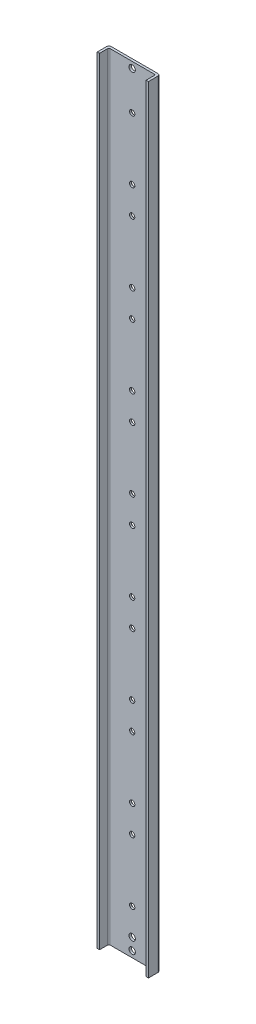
from build123d import *

# Parameters (mm, degrees)
SKETCH1_W                   = 66
SKETCH1_H                   = 15
BOSS_EXTRUDE1_DEPTH         = 500
SKETCH2_W                   = 60
SKETCH2_H                   = 12
CUT_EXTRUDE1_DEPTH          = 1001.572461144
FILLET1_R                   = 3
FILLET2_R                   = 1.5
M8_TAPPED_HOLE1_AT_2_COUNT  = 2
M8_TAPPED_HOLE1_AT_2_PITCH  = 80
M8_TAPPED_HOLE1_AT_3_COUNT  = 2
M8_TAPPED_HOLE1_AT_3_PITCH  = 115
M8_TAPPED_HOLE1_AT_4_COUNT  = 2
M8_TAPPED_HOLE1_AT_4_PITCH  = 195
M8_TAPPED_HOLE1_AT_5_COUNT  = 2
M8_TAPPED_HOLE1_AT_5_PITCH  = 230
M8_TAPPED_HOLE1_AT_6_COUNT  = 2
M8_TAPPED_HOLE1_AT_6_PITCH  = 310
M8_TAPPED_HOLE1_AT_7_COUNT  = 2
M8_TAPPED_HOLE1_AT_7_PITCH  = 345
M8_TAPPED_HOLE1_AT_8_COUNT  = 2
M8_TAPPED_HOLE1_AT_8_PITCH  = 425
M8_TAPPED_HOLE1_AT_9_COUNT  = 2
M8_TAPPED_HOLE1_AT_9_PITCH  = 460
M8_TAPPED_HOLE1_AT_10_COUNT = 2
M8_TAPPED_HOLE1_AT_10_PITCH = 540
M8_TAPPED_HOLE1_AT_11_COUNT = 2
M8_TAPPED_HOLE1_AT_11_PITCH = 575
M8_TAPPED_HOLE1_AT_12_COUNT = 2
M8_TAPPED_HOLE1_AT_12_PITCH = 655
M8_TAPPED_HOLE1_AT_13_COUNT = 2
M8_TAPPED_HOLE1_AT_13_PITCH = 690
M8_TAPPED_HOLE1_AT_14_COUNT = 2
M8_TAPPED_HOLE1_AT_14_PITCH = 770
M8_TAPPED_HOLE1_AT_15_COUNT = 2
M8_TAPPED_HOLE1_AT_15_PITCH = 805
M8_TAPPED_HOLE1_AT_16_COUNT = 2
M8_TAPPED_HOLE1_AT_16_PITCH = 885
SKETCH7_R                   = 4.1
CUT_EXTRUDE2_DEPTH          = 10
SKETCH8_R                   = 4.1
CUT_EXTRUDE3_DEPTH          = 10


with BuildPart() as part:
    # Sketch1 → Boss-Extrude1 (new, symmetric)
    with BuildSketch(Plane(origin=(0, 0, 0), x_dir=(1, 0, 0), z_dir=(0, 1, 0))):
        Rectangle(SKETCH1_W, SKETCH1_H)
    extrude(amount=BOSS_EXTRUDE1_DEPTH, both=True)

    # Sketch2 → Cut-Extrude1 (cut, through all)
    with BuildSketch(Plane.XZ.offset(500)):
        with Locations((0, 1.5)):
            Rectangle(SKETCH2_W, SKETCH2_H)
    extrude(amount=-CUT_EXTRUDE1_DEPTH, mode=Mode.SUBTRACT)

    # Fillet1
    fillet1_edges = [part.edges().sort_by_distance(p)[0] for p in [
        (-33, 0, -7.5),
        (33, 0, -7.5),
    ]]
    fillet(fillet1_edges, radius=FILLET1_R)

    # Fillet2
    fillet2_edges = [part.edges().sort_by_distance(p)[0] for p in [
        (-30, 0, -4.5),
        (30, 0, -4.5),
    ]]
    fillet(fillet2_edges, radius=FILLET2_R)

    # Sketch6 → M8 Tapped Hole1 (revolve, cut)
    with BuildSketch(Plane(origin=(0, 442.5, -7.5), x_dir=(0, 1, 0), z_dir=(1, 0, 0))):
        Polygon((0, 0), (0, 3), (3.4, 3), (3.4, 0.625), (4.025, 0), align=None)
    m8_tapped_hole1 = revolve(axis=Axis((0, 442.5, -13.85), (0, 0, 1)), mode=Mode.SUBTRACT)

    # M8 Tapped Hole1 at 2: M8 Tapped Hole1 ×2
    with Locations(*[(0, -i * M8_TAPPED_HOLE1_AT_2_PITCH, 0) for i in range(1, M8_TAPPED_HOLE1_AT_2_COUNT)]):
        add(m8_tapped_hole1, mode=Mode.SUBTRACT)

    # M8 Tapped Hole1 at 3: M8 Tapped Hole1 ×2
    with Locations(*[(0, -i * M8_TAPPED_HOLE1_AT_3_PITCH, 0) for i in range(1, M8_TAPPED_HOLE1_AT_3_COUNT)]):
        add(m8_tapped_hole1, mode=Mode.SUBTRACT)

    # M8 Tapped Hole1 at 4: M8 Tapped Hole1 ×2
    with Locations(*[(0, -i * M8_TAPPED_HOLE1_AT_4_PITCH, 0) for i in range(1, M8_TAPPED_HOLE1_AT_4_COUNT)]):
        add(m8_tapped_hole1, mode=Mode.SUBTRACT)

    # M8 Tapped Hole1 at 5: M8 Tapped Hole1 ×2
    with Locations(*[(0, -i * M8_TAPPED_HOLE1_AT_5_PITCH, 0) for i in range(1, M8_TAPPED_HOLE1_AT_5_COUNT)]):
        add(m8_tapped_hole1, mode=Mode.SUBTRACT)

    # M8 Tapped Hole1 at 6: M8 Tapped Hole1 ×2
    with Locations(*[(0, -i * M8_TAPPED_HOLE1_AT_6_PITCH, 0) for i in range(1, M8_TAPPED_HOLE1_AT_6_COUNT)]):
        add(m8_tapped_hole1, mode=Mode.SUBTRACT)

    # M8 Tapped Hole1 at 7: M8 Tapped Hole1 ×2
    with Locations(*[(0, -i * M8_TAPPED_HOLE1_AT_7_PITCH, 0) for i in range(1, M8_TAPPED_HOLE1_AT_7_COUNT)]):
        add(m8_tapped_hole1, mode=Mode.SUBTRACT)

    # M8 Tapped Hole1 at 8: M8 Tapped Hole1 ×2
    with Locations(*[(0, -i * M8_TAPPED_HOLE1_AT_8_PITCH, 0) for i in range(1, M8_TAPPED_HOLE1_AT_8_COUNT)]):
        add(m8_tapped_hole1, mode=Mode.SUBTRACT)

    # M8 Tapped Hole1 at 9: M8 Tapped Hole1 ×2
    with Locations(*[(0, -i * M8_TAPPED_HOLE1_AT_9_PITCH, 0) for i in range(1, M8_TAPPED_HOLE1_AT_9_COUNT)]):
        add(m8_tapped_hole1, mode=Mode.SUBTRACT)

    # M8 Tapped Hole1 at 10: M8 Tapped Hole1 ×2
    with Locations(*[(0, -i * M8_TAPPED_HOLE1_AT_10_PITCH, 0) for i in range(1, M8_TAPPED_HOLE1_AT_10_COUNT)]):
        add(m8_tapped_hole1, mode=Mode.SUBTRACT)

    # M8 Tapped Hole1 at 11: M8 Tapped Hole1 ×2
    with Locations(*[(0, -i * M8_TAPPED_HOLE1_AT_11_PITCH, 0) for i in range(1, M8_TAPPED_HOLE1_AT_11_COUNT)]):
        add(m8_tapped_hole1, mode=Mode.SUBTRACT)

    # M8 Tapped Hole1 at 12: M8 Tapped Hole1 ×2
    with Locations(*[(0, -i * M8_TAPPED_HOLE1_AT_12_PITCH, 0) for i in range(1, M8_TAPPED_HOLE1_AT_12_COUNT)]):
        add(m8_tapped_hole1, mode=Mode.SUBTRACT)

    # M8 Tapped Hole1 at 13: M8 Tapped Hole1 ×2
    with Locations(*[(0, -i * M8_TAPPED_HOLE1_AT_13_PITCH, 0) for i in range(1, M8_TAPPED_HOLE1_AT_13_COUNT)]):
        add(m8_tapped_hole1, mode=Mode.SUBTRACT)

    # M8 Tapped Hole1 at 14: M8 Tapped Hole1 ×2
    with Locations(*[(0, -i * M8_TAPPED_HOLE1_AT_14_PITCH, 0) for i in range(1, M8_TAPPED_HOLE1_AT_14_COUNT)]):
        add(m8_tapped_hole1, mode=Mode.SUBTRACT)

    # M8 Tapped Hole1 at 15: M8 Tapped Hole1 ×2
    with Locations(*[(0, -i * M8_TAPPED_HOLE1_AT_15_PITCH, 0) for i in range(1, M8_TAPPED_HOLE1_AT_15_COUNT)]):
        add(m8_tapped_hole1, mode=Mode.SUBTRACT)

    # M8 Tapped Hole1 at 16: M8 Tapped Hole1 ×2
    with Locations(*[(0, -i * M8_TAPPED_HOLE1_AT_16_PITCH, 0) for i in range(1, M8_TAPPED_HOLE1_AT_16_COUNT)]):
        add(m8_tapped_hole1, mode=Mode.SUBTRACT)

    # Sketch7 → Cut-Extrude2 (cut)
    with BuildSketch(Plane(origin=(0, 0, -7.5), x_dir=(-1, 0, 0), z_dir=(0, 0, -1))):
        with Locations((0, -492)):
            Circle(SKETCH7_R)
        with Locations((0, -477)):
            Circle(SKETCH7_R)
    extrude(amount=-CUT_EXTRUDE2_DEPTH, mode=Mode.SUBTRACT)

    # Sketch8 → Cut-Extrude3 (cut)
    with BuildSketch(Plane(origin=(0, 0, -7.5), x_dir=(-1, 0, 0), z_dir=(0, 0, -1))):
        with Locations((0, 492)):
            Circle(SKETCH8_R)
    extrude(amount=-CUT_EXTRUDE3_DEPTH, mode=Mode.SUBTRACT)


solid = part.part
